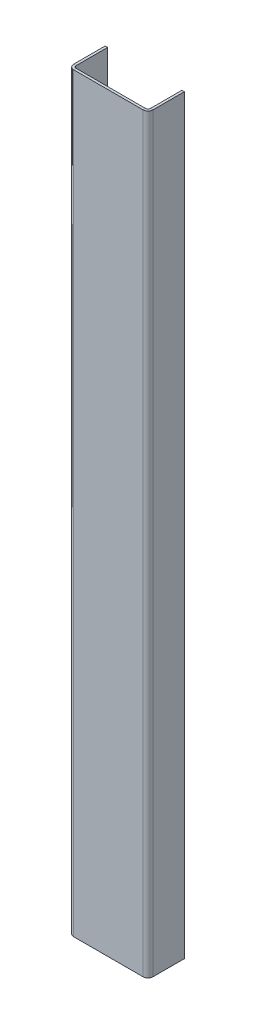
ISO-10303-21;
HEADER;
FILE_DESCRIPTION(('STEP AP214'),'2;1');
FILE_NAME('part.step','',(''),(''),'','','');
FILE_SCHEMA(('AUTOMOTIVE_DESIGN { 1 0 10303 214 1 1 1 1 }'));
ENDSEC;
DATA;
#1=APPLICATION_CONTEXT('core data for automotive mechanical design processes');
#2=APPLICATION_PROTOCOL_DEFINITION('international standard','automotive_design',2000,#1);
#3=PRODUCT_CONTEXT('',#1,'mechanical');
#4=PRODUCT('Part','Part','',(#3));
#5=PRODUCT_RELATED_PRODUCT_CATEGORY('part','',(#4));
#6=PRODUCT_DEFINITION_FORMATION('','',#4);
#7=PRODUCT_DEFINITION_CONTEXT('part definition',#1,'design');
#8=PRODUCT_DEFINITION('design','',#6,#7);
#9=PRODUCT_DEFINITION_SHAPE('','',#8);
#10=(LENGTH_UNIT() NAMED_UNIT(*) SI_UNIT(.MILLI.,.METRE.));
#11=(NAMED_UNIT(*) PLANE_ANGLE_UNIT() SI_UNIT($,.RADIAN.));
#12=(NAMED_UNIT(*) SI_UNIT($,.STERADIAN.) SOLID_ANGLE_UNIT());
#13=UNCERTAINTY_MEASURE_WITH_UNIT(LENGTH_MEASURE(1.E-05),#10,'distance_accuracy_value','');
#14=(GEOMETRIC_REPRESENTATION_CONTEXT(3) GLOBAL_UNCERTAINTY_ASSIGNED_CONTEXT((#13)) GLOBAL_UNIT_ASSIGNED_CONTEXT((#10,
#11,#12)) REPRESENTATION_CONTEXT('',''));
#15=CARTESIAN_POINT('',(0.,0.,0.));
#16=DIRECTION('',(0.,0.,1.));
#17=DIRECTION('',(1.,0.,0.));
#18=AXIS2_PLACEMENT_3D('',#15,#16,#17);
#19=CARTESIAN_POINT('',(66.6749999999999,1444.625,0.));
#20=DIRECTION('',(0.,1.,0.));
#21=DIRECTION('',(0.,0.,1.));
#22=AXIS2_PLACEMENT_3D('',#19,#20,#21);
#23=PLANE('',#22);
#24=DIRECTION('',(0.,0.,-1.));
#25=VECTOR('',#24,1.);
#26=CARTESIAN_POINT('',(66.6749999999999,1444.625,0.));
#27=LINE('',#26,#25);
#28=CARTESIAN_POINT('',(66.6749999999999,1444.625,0.));
#29=VERTEX_POINT('',#28);
#30=CARTESIAN_POINT('',(66.6749999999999,1444.625,-4.7625));
#31=VERTEX_POINT('',#30);
#32=EDGE_CURVE('E11',#29,#31,#27,.T.);
#33=ORIENTED_EDGE('',*,*,#32,.F.);
#34=CARTESIAN_POINT('',(66.675,1444.625,-9.525));
#35=DIRECTION('',(0.,1.,0.));
#36=DIRECTION('',(0.,0.,1.));
#37=AXIS2_PLACEMENT_3D('',#34,#35,#36);
#38=CIRCLE('',#37,9.525);
#39=CARTESIAN_POINT('',(76.2,1444.625,-9.525));
#40=VERTEX_POINT('',#39);
#41=EDGE_CURVE('E247',#40,#29,#38,.F.);
#42=ORIENTED_EDGE('',*,*,#41,.F.);
#43=DIRECTION('',(1.,0.,0.));
#44=VECTOR('',#43,1.);
#45=CARTESIAN_POINT('',(71.4375,1444.625,-9.525));
#46=LINE('',#45,#44);
#47=CARTESIAN_POINT('',(71.4375,1444.625,-9.525));
#48=VERTEX_POINT('',#47);
#49=EDGE_CURVE('E45',#48,#40,#46,.T.);
#50=ORIENTED_EDGE('',*,*,#49,.F.);
#51=CARTESIAN_POINT('',(66.675,1444.625,-9.525));
#52=DIRECTION('',(0.,1.,0.));
#53=DIRECTION('',(1.,0.,0.));
#54=AXIS2_PLACEMENT_3D('',#51,#52,#53);
#55=CIRCLE('',#54,4.7625);
#56=EDGE_CURVE('E146',#48,#31,#55,.F.);
#57=ORIENTED_EDGE('',*,*,#56,.T.);
#58=EDGE_LOOP('',(#33,#42,#50,#57));
#59=FACE_BOUND('',#58,.T.);
#60=ADVANCED_FACE('F37',(#59),#23,.T.);
#61=CARTESIAN_POINT('',(71.4375,1444.625,-9.525));
#62=DIRECTION('',(0.,1.,0.));
#63=DIRECTION('',(0.,0.,1.));
#64=AXIS2_PLACEMENT_3D('',#61,#62,#63);
#65=PLANE('',#64);
#66=DIRECTION('',(-1.,0.,0.));
#67=VECTOR('',#66,1.);
#68=CARTESIAN_POINT('',(-76.2,1444.625,0.));
#69=LINE('',#68,#67);
#70=CARTESIAN_POINT('',(-66.675,1444.625,0.));
#71=VERTEX_POINT('',#70);
#72=EDGE_CURVE('E140',#29,#71,#69,.T.);
#73=ORIENTED_EDGE('',*,*,#72,.F.);
#74=ORIENTED_EDGE('',*,*,#32,.T.);
#75=DIRECTION('',(1.,0.,0.));
#76=VECTOR('',#75,1.);
#77=CARTESIAN_POINT('',(-76.2,1444.625,-4.7625));
#78=LINE('',#77,#76);
#79=CARTESIAN_POINT('',(-66.675,1444.625,-4.7625));
#80=VERTEX_POINT('',#79);
#81=EDGE_CURVE('E137',#31,#80,#78,.F.);
#82=ORIENTED_EDGE('',*,*,#81,.T.);
#83=DIRECTION('',(0.,0.,1.));
#84=VECTOR('',#83,1.);
#85=CARTESIAN_POINT('',(-66.675,1444.625,-4.7625));
#86=LINE('',#85,#84);
#87=EDGE_CURVE('E228',#80,#71,#86,.T.);
#88=ORIENTED_EDGE('',*,*,#87,.T.);
#89=EDGE_LOOP('',(#73,#74,#82,#88));
#90=FACE_BOUND('',#89,.T.);
#91=ADVANCED_FACE('F135',(#90),#65,.T.);
#92=CARTESIAN_POINT('',(76.2,0.,-9.525));
#93=DIRECTION('',(0.,-1.,0.));
#94=DIRECTION('',(0.,0.,-1.));
#95=AXIS2_PLACEMENT_3D('',#92,#93,#94);
#96=PLANE('',#95);
#97=DIRECTION('',(-1.,0.,0.));
#98=VECTOR('',#97,1.);
#99=CARTESIAN_POINT('',(76.2,0.,-9.525));
#100=LINE('',#99,#98);
#101=CARTESIAN_POINT('',(76.2,0.,-9.525));
#102=VERTEX_POINT('',#101);
#103=CARTESIAN_POINT('',(71.4375,0.,-9.525));
#104=VERTEX_POINT('',#103);
#105=EDGE_CURVE('E233',#102,#104,#100,.T.);
#106=ORIENTED_EDGE('',*,*,#105,.F.);
#107=CARTESIAN_POINT('',(66.675,0.,-9.525));
#108=DIRECTION('',(0.,1.,0.));
#109=DIRECTION('',(0.,0.,1.));
#110=AXIS2_PLACEMENT_3D('',#107,#108,#109);
#111=CIRCLE('',#110,9.525);
#112=CARTESIAN_POINT('',(66.6749999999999,0.,0.));
#113=VERTEX_POINT('',#112);
#114=EDGE_CURVE('E185',#102,#113,#111,.F.);
#115=ORIENTED_EDGE('',*,*,#114,.T.);
#116=DIRECTION('',(0.,0.,1.));
#117=VECTOR('',#116,1.);
#118=CARTESIAN_POINT('',(66.6749999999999,0.,-4.7625));
#119=LINE('',#118,#117);
#120=CARTESIAN_POINT('',(66.6749999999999,0.,-4.7625));
#121=VERTEX_POINT('',#120);
#122=EDGE_CURVE('E231',#121,#113,#119,.T.);
#123=ORIENTED_EDGE('',*,*,#122,.F.);
#124=CARTESIAN_POINT('',(66.675,0.,-9.525));
#125=DIRECTION('',(0.,1.,0.));
#126=DIRECTION('',(1.,0.,0.));
#127=AXIS2_PLACEMENT_3D('',#124,#125,#126);
#128=CIRCLE('',#127,4.7625);
#129=EDGE_CURVE('E158',#104,#121,#128,.F.);
#130=ORIENTED_EDGE('',*,*,#129,.F.);
#131=EDGE_LOOP('',(#106,#115,#123,#130));
#132=FACE_BOUND('',#131,.T.);
#133=ADVANCED_FACE('F285',(#132),#96,.T.);
#134=CARTESIAN_POINT('',(66.6749999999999,0.,-4.7625));
#135=DIRECTION('',(0.,-1.,0.));
#136=DIRECTION('',(0.,0.,-1.));
#137=AXIS2_PLACEMENT_3D('',#134,#135,#136);
#138=PLANE('',#137);
#139=DIRECTION('',(0.,0.,1.));
#140=VECTOR('',#139,1.);
#141=CARTESIAN_POINT('',(76.2,0.,0.));
#142=LINE('',#141,#140);
#143=CARTESIAN_POINT('',(76.2,0.,-69.85));
#144=VERTEX_POINT('',#143);
#145=EDGE_CURVE('E188',#144,#102,#142,.T.);
#146=ORIENTED_EDGE('',*,*,#145,.T.);
#147=ORIENTED_EDGE('',*,*,#105,.T.);
#148=DIRECTION('',(0.,0.,-1.));
#149=VECTOR('',#148,1.);
#150=CARTESIAN_POINT('',(71.4375,0.,0.));
#151=LINE('',#150,#149);
#152=CARTESIAN_POINT('',(71.4375,0.,-69.85));
#153=VERTEX_POINT('',#152);
#154=EDGE_CURVE('E194',#153,#104,#151,.F.);
#155=ORIENTED_EDGE('',*,*,#154,.F.);
#156=DIRECTION('',(1.,0.,0.));
#157=VECTOR('',#156,1.);
#158=CARTESIAN_POINT('',(71.4375,0.,-69.85));
#159=LINE('',#158,#157);
#160=EDGE_CURVE('E191',#153,#144,#159,.T.);
#161=ORIENTED_EDGE('',*,*,#160,.T.);
#162=EDGE_LOOP('',(#146,#147,#155,#161));
#163=FACE_BOUND('',#162,.T.);
#164=ADVANCED_FACE('F288',(#163),#138,.T.);
#165=CARTESIAN_POINT('',(-76.2,1444.625,-9.525));
#166=DIRECTION('',(0.,1.,0.));
#167=DIRECTION('',(0.,0.,1.));
#168=AXIS2_PLACEMENT_3D('',#165,#166,#167);
#169=PLANE('',#168);
#170=DIRECTION('',(1.,0.,0.));
#171=VECTOR('',#170,1.);
#172=CARTESIAN_POINT('',(-76.2,1444.625,-9.525));
#173=LINE('',#172,#171);
#174=CARTESIAN_POINT('',(-76.2,1444.625,-9.525));
#175=VERTEX_POINT('',#174);
#176=CARTESIAN_POINT('',(-71.4375,1444.625,-9.525));
#177=VERTEX_POINT('',#176);
#178=EDGE_CURVE('E53',#175,#177,#173,.T.);
#179=ORIENTED_EDGE('',*,*,#178,.F.);
#180=CARTESIAN_POINT('',(-66.675,1444.625,-9.525));
#181=DIRECTION('',(0.,1.,0.));
#182=DIRECTION('',(0.,0.,1.));
#183=AXIS2_PLACEMENT_3D('',#180,#181,#182);
#184=CIRCLE('',#183,9.525);
#185=EDGE_CURVE('E257',#71,#175,#184,.F.);
#186=ORIENTED_EDGE('',*,*,#185,.F.);
#187=ORIENTED_EDGE('',*,*,#87,.F.);
#188=CARTESIAN_POINT('',(-66.675,1444.625,-9.525));
#189=DIRECTION('',(0.,1.,0.));
#190=DIRECTION('',(1.,0.,0.));
#191=AXIS2_PLACEMENT_3D('',#188,#189,#190);
#192=CIRCLE('',#191,4.7625);
#193=EDGE_CURVE('E166',#80,#177,#192,.F.);
#194=ORIENTED_EDGE('',*,*,#193,.T.);
#195=EDGE_LOOP('',(#179,#186,#187,#194));
#196=FACE_BOUND('',#195,.T.);
#197=ADVANCED_FACE('F280',(#196),#169,.T.);
#198=CARTESIAN_POINT('',(-66.675,1444.625,-4.7625));
#199=DIRECTION('',(0.,1.,0.));
#200=DIRECTION('',(0.,0.,1.));
#201=AXIS2_PLACEMENT_3D('',#198,#199,#200);
#202=PLANE('',#201);
#203=DIRECTION('',(0.,0.,-1.));
#204=VECTOR('',#203,1.);
#205=CARTESIAN_POINT('',(-76.2,1444.625,0.));
#206=LINE('',#205,#204);
#207=CARTESIAN_POINT('',(-76.2,1444.625,-69.85));
#208=VERTEX_POINT('',#207);
#209=EDGE_CURVE('E260',#175,#208,#206,.T.);
#210=ORIENTED_EDGE('',*,*,#209,.F.);
#211=ORIENTED_EDGE('',*,*,#178,.T.);
#212=DIRECTION('',(0.,0.,-1.));
#213=VECTOR('',#212,1.);
#214=CARTESIAN_POINT('',(-71.4375,1444.625,0.));
#215=LINE('',#214,#213);
#216=CARTESIAN_POINT('',(-71.4375,1444.625,-69.85));
#217=VERTEX_POINT('',#216);
#218=EDGE_CURVE('E107',#177,#217,#215,.T.);
#219=ORIENTED_EDGE('',*,*,#218,.T.);
#220=DIRECTION('',(1.,0.,0.));
#221=VECTOR('',#220,1.);
#222=CARTESIAN_POINT('',(-76.2,1444.625,-69.85));
#223=LINE('',#222,#221);
#224=EDGE_CURVE('E263',#208,#217,#223,.T.);
#225=ORIENTED_EDGE('',*,*,#224,.F.);
#226=EDGE_LOOP('',(#210,#211,#219,#225));
#227=FACE_BOUND('',#226,.T.);
#228=ADVANCED_FACE('F269',(#227),#202,.T.);
#229=CARTESIAN_POINT('',(-66.675,0.,0.));
#230=DIRECTION('',(0.,-1.,0.));
#231=DIRECTION('',(0.,0.,-1.));
#232=AXIS2_PLACEMENT_3D('',#229,#230,#231);
#233=PLANE('',#232);
#234=DIRECTION('',(0.,0.,-1.));
#235=VECTOR('',#234,1.);
#236=CARTESIAN_POINT('',(-66.675,0.,0.));
#237=LINE('',#236,#235);
#238=CARTESIAN_POINT('',(-66.675,0.,0.));
#239=VERTEX_POINT('',#238);
#240=CARTESIAN_POINT('',(-66.675,0.,-4.7625));
#241=VERTEX_POINT('',#240);
#242=EDGE_CURVE('E94',#239,#241,#237,.T.);
#243=ORIENTED_EDGE('',*,*,#242,.F.);
#244=CARTESIAN_POINT('',(-66.675,0.,-9.525));
#245=DIRECTION('',(0.,1.,0.));
#246=DIRECTION('',(0.,0.,1.));
#247=AXIS2_PLACEMENT_3D('',#244,#245,#246);
#248=CIRCLE('',#247,9.525);
#249=CARTESIAN_POINT('',(-76.2,0.,-9.525));
#250=VERTEX_POINT('',#249);
#251=EDGE_CURVE('E181',#239,#250,#248,.F.);
#252=ORIENTED_EDGE('',*,*,#251,.T.);
#253=DIRECTION('',(-1.,0.,0.));
#254=VECTOR('',#253,1.);
#255=CARTESIAN_POINT('',(-71.4375,0.,-9.525));
#256=LINE('',#255,#254);
#257=CARTESIAN_POINT('',(-71.4375,0.,-9.525));
#258=VERTEX_POINT('',#257);
#259=EDGE_CURVE('E101',#258,#250,#256,.T.);
#260=ORIENTED_EDGE('',*,*,#259,.F.);
#261=CARTESIAN_POINT('',(-66.675,0.,-9.525));
#262=DIRECTION('',(0.,1.,0.));
#263=DIRECTION('',(1.,0.,0.));
#264=AXIS2_PLACEMENT_3D('',#261,#262,#263);
#265=CIRCLE('',#264,4.7625);
#266=EDGE_CURVE('E200',#241,#258,#265,.F.);
#267=ORIENTED_EDGE('',*,*,#266,.F.);
#268=EDGE_LOOP('',(#243,#252,#260,#267));
#269=FACE_BOUND('',#268,.T.);
#270=ADVANCED_FACE('F317',(#269),#233,.T.);
#271=CARTESIAN_POINT('',(-71.4375,0.,-9.525));
#272=DIRECTION('',(0.,-1.,0.));
#273=DIRECTION('',(0.,0.,-1.));
#274=AXIS2_PLACEMENT_3D('',#271,#272,#273);
#275=PLANE('',#274);
#276=DIRECTION('',(-1.,0.,0.));
#277=VECTOR('',#276,1.);
#278=CARTESIAN_POINT('',(-76.2,0.,0.));
#279=LINE('',#278,#277);
#280=EDGE_CURVE('E183',#113,#239,#279,.T.);
#281=ORIENTED_EDGE('',*,*,#280,.T.);
#282=ORIENTED_EDGE('',*,*,#242,.T.);
#283=DIRECTION('',(1.,0.,0.));
#284=VECTOR('',#283,1.);
#285=CARTESIAN_POINT('',(-76.2,0.,-4.7625));
#286=LINE('',#285,#284);
#287=EDGE_CURVE('E198',#121,#241,#286,.F.);
#288=ORIENTED_EDGE('',*,*,#287,.F.);
#289=ORIENTED_EDGE('',*,*,#122,.T.);
#290=EDGE_LOOP('',(#281,#282,#288,#289));
#291=FACE_BOUND('',#290,.T.);
#292=ADVANCED_FACE('F320',(#291),#275,.T.);
#293=CARTESIAN_POINT('',(-71.4375,1444.625,0.));
#294=DIRECTION('',(-1.,0.,0.));
#295=DIRECTION('',(0.,0.,1.));
#296=AXIS2_PLACEMENT_3D('',#293,#294,#295);
#297=PLANE('',#296);
#298=DIRECTION('',(0.,0.,-1.));
#299=VECTOR('',#298,1.);
#300=CARTESIAN_POINT('',(-71.4375,0.,0.));
#301=LINE('',#300,#299);
#302=CARTESIAN_POINT('',(-71.4375,0.,-69.85));
#303=VERTEX_POINT('',#302);
#304=EDGE_CURVE('E172',#258,#303,#301,.T.);
#305=ORIENTED_EDGE('',*,*,#304,.T.);
#306=DIRECTION('',(0.,-1.,0.));
#307=VECTOR('',#306,1.);
#308=CARTESIAN_POINT('',(-71.4375,1444.625,-69.85));
#309=LINE('',#308,#307);
#310=EDGE_CURVE('E224',#217,#303,#309,.T.);
#311=ORIENTED_EDGE('',*,*,#310,.F.);
#312=ORIENTED_EDGE('',*,*,#218,.F.);
#313=DIRECTION('',(0.,-1.,0.));
#314=VECTOR('',#313,1.);
#315=CARTESIAN_POINT('',(-71.4375,1444.625,-9.525));
#316=LINE('',#315,#314);
#317=EDGE_CURVE('E168',#177,#258,#316,.T.);
#318=ORIENTED_EDGE('',*,*,#317,.T.);
#319=EDGE_LOOP('',(#305,#311,#312,#318));
#320=FACE_BOUND('',#319,.T.);
#321=ADVANCED_FACE('F323',(#320),#297,.F.);
#322=CARTESIAN_POINT('',(-76.2,1444.625,-69.85));
#323=DIRECTION('',(0.,0.,-1.));
#324=DIRECTION('',(-1.,0.,0.));
#325=AXIS2_PLACEMENT_3D('',#322,#323,#324);
#326=PLANE('',#325);
#327=DIRECTION('',(1.,0.,0.));
#328=VECTOR('',#327,1.);
#329=CARTESIAN_POINT('',(-76.2,0.,-69.85));
#330=LINE('',#329,#328);
#331=CARTESIAN_POINT('',(-76.2,0.,-69.85));
#332=VERTEX_POINT('',#331);
#333=EDGE_CURVE('E175',#332,#303,#330,.T.);
#334=ORIENTED_EDGE('',*,*,#333,.F.);
#335=DIRECTION('',(0.,-1.,0.));
#336=VECTOR('',#335,1.);
#337=CARTESIAN_POINT('',(-76.2,1444.625,-69.85));
#338=LINE('',#337,#336);
#339=EDGE_CURVE('E222',#208,#332,#338,.T.);
#340=ORIENTED_EDGE('',*,*,#339,.F.);
#341=ORIENTED_EDGE('',*,*,#224,.T.);
#342=ORIENTED_EDGE('',*,*,#310,.T.);
#343=EDGE_LOOP('',(#334,#340,#341,#342));
#344=FACE_BOUND('',#343,.T.);
#345=ADVANCED_FACE('F268',(#344),#326,.T.);
#346=CARTESIAN_POINT('',(-76.2,1444.625,0.));
#347=DIRECTION('',(-1.,0.,0.));
#348=DIRECTION('',(0.,0.,1.));
#349=AXIS2_PLACEMENT_3D('',#346,#347,#348);
#350=PLANE('',#349);
#351=DIRECTION('',(0.,0.,-1.));
#352=VECTOR('',#351,1.);
#353=CARTESIAN_POINT('',(-76.2,0.,0.));
#354=LINE('',#353,#352);
#355=EDGE_CURVE('E178',#250,#332,#354,.T.);
#356=ORIENTED_EDGE('',*,*,#355,.F.);
#357=DIRECTION('',(0.,-1.,0.));
#358=VECTOR('',#357,1.);
#359=CARTESIAN_POINT('',(-76.2,1444.625,-9.525));
#360=LINE('',#359,#358);
#361=EDGE_CURVE('E219',#175,#250,#360,.T.);
#362=ORIENTED_EDGE('',*,*,#361,.F.);
#363=ORIENTED_EDGE('',*,*,#209,.T.);
#364=ORIENTED_EDGE('',*,*,#339,.T.);
#365=EDGE_LOOP('',(#356,#362,#363,#364));
#366=FACE_BOUND('',#365,.T.);
#367=ADVANCED_FACE('F273',(#366),#350,.T.);
#368=CARTESIAN_POINT('',(-66.675,1444.625,-9.525));
#369=DIRECTION('',(0.,-1.,0.));
#370=DIRECTION('',(0.,0.,-1.));
#371=AXIS2_PLACEMENT_3D('',#368,#369,#370);
#372=CYLINDRICAL_SURFACE('',#371,9.525);
#373=ORIENTED_EDGE('',*,*,#251,.F.);
#374=DIRECTION('',(0.,-1.,0.));
#375=VECTOR('',#374,1.);
#376=CARTESIAN_POINT('',(-66.675,1444.625,0.));
#377=LINE('',#376,#375);
#378=EDGE_CURVE('E216',#71,#239,#377,.T.);
#379=ORIENTED_EDGE('',*,*,#378,.F.);
#380=ORIENTED_EDGE('',*,*,#185,.T.);
#381=ORIENTED_EDGE('',*,*,#361,.T.);
#382=EDGE_LOOP('',(#373,#379,#380,#381));
#383=FACE_BOUND('',#382,.T.);
#384=ADVANCED_FACE('F276',(#383),#372,.T.);
#385=CARTESIAN_POINT('',(-76.2,1444.625,0.));
#386=DIRECTION('',(0.,0.,1.));
#387=DIRECTION('',(1.,0.,0.));
#388=AXIS2_PLACEMENT_3D('',#385,#386,#387);
#389=PLANE('',#388);
#390=ORIENTED_EDGE('',*,*,#280,.F.);
#391=DIRECTION('',(0.,-1.,0.));
#392=VECTOR('',#391,1.);
#393=CARTESIAN_POINT('',(66.6749999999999,1444.625,0.));
#394=LINE('',#393,#392);
#395=EDGE_CURVE('E213',#29,#113,#394,.T.);
#396=ORIENTED_EDGE('',*,*,#395,.F.);
#397=ORIENTED_EDGE('',*,*,#72,.T.);
#398=ORIENTED_EDGE('',*,*,#378,.T.);
#399=EDGE_LOOP('',(#390,#396,#397,#398));
#400=FACE_BOUND('',#399,.T.);
#401=ADVANCED_FACE('F283',(#400),#389,.T.);
#402=CARTESIAN_POINT('',(66.675,1444.625,-9.525));
#403=DIRECTION('',(0.,-1.,0.));
#404=DIRECTION('',(0.,0.,-1.));
#405=AXIS2_PLACEMENT_3D('',#402,#403,#404);
#406=CYLINDRICAL_SURFACE('',#405,9.525);
#407=ORIENTED_EDGE('',*,*,#114,.F.);
#408=DIRECTION('',(0.,-1.,0.));
#409=VECTOR('',#408,1.);
#410=CARTESIAN_POINT('',(76.2,1444.625,-9.525));
#411=LINE('',#410,#409);
#412=EDGE_CURVE('E210',#40,#102,#411,.T.);
#413=ORIENTED_EDGE('',*,*,#412,.F.);
#414=ORIENTED_EDGE('',*,*,#41,.T.);
#415=ORIENTED_EDGE('',*,*,#395,.T.);
#416=EDGE_LOOP('',(#407,#413,#414,#415));
#417=FACE_BOUND('',#416,.T.);
#418=ADVANCED_FACE('F246',(#417),#406,.T.);
#419=CARTESIAN_POINT('',(76.2,1444.625,0.));
#420=DIRECTION('',(1.,0.,0.));
#421=DIRECTION('',(0.,0.,-1.));
#422=AXIS2_PLACEMENT_3D('',#419,#420,#421);
#423=PLANE('',#422);
#424=ORIENTED_EDGE('',*,*,#145,.F.);
#425=DIRECTION('',(0.,-1.,0.));
#426=VECTOR('',#425,1.);
#427=CARTESIAN_POINT('',(76.2,1444.625,-69.85));
#428=LINE('',#427,#426);
#429=CARTESIAN_POINT('',(76.2,1444.625,-69.85));
#430=VERTEX_POINT('',#429);
#431=EDGE_CURVE('E208',#430,#144,#428,.T.);
#432=ORIENTED_EDGE('',*,*,#431,.F.);
#433=DIRECTION('',(0.,0.,1.));
#434=VECTOR('',#433,1.);
#435=CARTESIAN_POINT('',(76.2,1444.625,0.));
#436=LINE('',#435,#434);
#437=EDGE_CURVE('E240',#430,#40,#436,.T.);
#438=ORIENTED_EDGE('',*,*,#437,.T.);
#439=ORIENTED_EDGE('',*,*,#412,.T.);
#440=EDGE_LOOP('',(#424,#432,#438,#439));
#441=FACE_BOUND('',#440,.T.);
#442=ADVANCED_FACE('F251',(#441),#423,.T.);
#443=CARTESIAN_POINT('',(71.4375,1444.625,-69.85));
#444=DIRECTION('',(0.,0.,-1.));
#445=DIRECTION('',(-1.,0.,0.));
#446=AXIS2_PLACEMENT_3D('',#443,#444,#445);
#447=PLANE('',#446);
#448=ORIENTED_EDGE('',*,*,#160,.F.);
#449=DIRECTION('',(0.,-1.,0.));
#450=VECTOR('',#449,1.);
#451=CARTESIAN_POINT('',(71.4375,1444.625,-69.85));
#452=LINE('',#451,#450);
#453=CARTESIAN_POINT('',(71.4375,1444.625,-69.85));
#454=VERTEX_POINT('',#453);
#455=EDGE_CURVE('E206',#454,#153,#452,.T.);
#456=ORIENTED_EDGE('',*,*,#455,.F.);
#457=DIRECTION('',(1.,0.,0.));
#458=VECTOR('',#457,1.);
#459=CARTESIAN_POINT('',(71.4375,1444.625,-69.85));
#460=LINE('',#459,#458);
#461=EDGE_CURVE('E252',#454,#430,#460,.T.);
#462=ORIENTED_EDGE('',*,*,#461,.T.);
#463=ORIENTED_EDGE('',*,*,#431,.T.);
#464=EDGE_LOOP('',(#448,#456,#462,#463));
#465=FACE_BOUND('',#464,.T.);
#466=ADVANCED_FACE('F293',(#465),#447,.T.);
#467=CARTESIAN_POINT('',(71.4375,1444.625,0.));
#468=DIRECTION('',(1.,0.,0.));
#469=DIRECTION('',(0.,0.,-1.));
#470=AXIS2_PLACEMENT_3D('',#467,#468,#469);
#471=PLANE('',#470);
#472=ORIENTED_EDGE('',*,*,#154,.T.);
#473=DIRECTION('',(0.,-1.,0.));
#474=VECTOR('',#473,1.);
#475=CARTESIAN_POINT('',(71.4375,1444.625,-9.525));
#476=LINE('',#475,#474);
#477=EDGE_CURVE('E160',#48,#104,#476,.T.);
#478=ORIENTED_EDGE('',*,*,#477,.F.);
#479=DIRECTION('',(0.,0.,-1.));
#480=VECTOR('',#479,1.);
#481=CARTESIAN_POINT('',(71.4375,1444.625,0.));
#482=LINE('',#481,#480);
#483=EDGE_CURVE('E151',#454,#48,#482,.F.);
#484=ORIENTED_EDGE('',*,*,#483,.F.);
#485=ORIENTED_EDGE('',*,*,#455,.T.);
#486=EDGE_LOOP('',(#472,#478,#484,#485));
#487=FACE_BOUND('',#486,.T.);
#488=ADVANCED_FACE('F291',(#487),#471,.F.);
#489=CARTESIAN_POINT('',(66.675,1444.625,-9.525));
#490=DIRECTION('',(0.,-1.,0.));
#491=DIRECTION('',(0.,0.,-1.));
#492=AXIS2_PLACEMENT_3D('',#489,#490,#491);
#493=CYLINDRICAL_SURFACE('',#492,4.7625);
#494=ORIENTED_EDGE('',*,*,#129,.T.);
#495=DIRECTION('',(0.,-1.,0.));
#496=VECTOR('',#495,1.);
#497=CARTESIAN_POINT('',(66.6749999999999,1444.625,-4.7625));
#498=LINE('',#497,#496);
#499=EDGE_CURVE('E155',#31,#121,#498,.T.);
#500=ORIENTED_EDGE('',*,*,#499,.F.);
#501=ORIENTED_EDGE('',*,*,#56,.F.);
#502=ORIENTED_EDGE('',*,*,#477,.T.);
#503=EDGE_LOOP('',(#494,#500,#501,#502));
#504=FACE_BOUND('',#503,.T.);
#505=ADVANCED_FACE('F156',(#504),#493,.F.);
#506=CARTESIAN_POINT('',(-76.2,1444.625,-4.7625));
#507=DIRECTION('',(0.,0.,1.));
#508=DIRECTION('',(1.,0.,0.));
#509=AXIS2_PLACEMENT_3D('',#506,#507,#508);
#510=PLANE('',#509);
#511=ORIENTED_EDGE('',*,*,#287,.T.);
#512=DIRECTION('',(0.,-1.,0.));
#513=VECTOR('',#512,1.);
#514=CARTESIAN_POINT('',(-66.675,1444.625,-4.7625));
#515=LINE('',#514,#513);
#516=EDGE_CURVE('E161',#80,#241,#515,.T.);
#517=ORIENTED_EDGE('',*,*,#516,.F.);
#518=ORIENTED_EDGE('',*,*,#81,.F.);
#519=ORIENTED_EDGE('',*,*,#499,.T.);
#520=EDGE_LOOP('',(#511,#517,#518,#519));
#521=FACE_BOUND('',#520,.T.);
#522=ADVANCED_FACE('F163',(#521),#510,.F.);
#523=CARTESIAN_POINT('',(-66.675,1444.625,-9.525));
#524=DIRECTION('',(0.,-1.,0.));
#525=DIRECTION('',(0.,0.,-1.));
#526=AXIS2_PLACEMENT_3D('',#523,#524,#525);
#527=CYLINDRICAL_SURFACE('',#526,4.7625);
#528=ORIENTED_EDGE('',*,*,#266,.T.);
#529=ORIENTED_EDGE('',*,*,#317,.F.);
#530=ORIENTED_EDGE('',*,*,#193,.F.);
#531=ORIENTED_EDGE('',*,*,#516,.T.);
#532=EDGE_LOOP('',(#528,#529,#530,#531));
#533=FACE_BOUND('',#532,.T.);
#534=ADVANCED_FACE('F375',(#533),#527,.F.);
#535=CARTESIAN_POINT('',(-66.675,1444.625,-9.525));
#536=DIRECTION('',(0.,1.,0.));
#537=DIRECTION('',(1.,0.,0.));
#538=AXIS2_PLACEMENT_3D('',#535,#536,#537);
#539=PLANE('',#538);
#540=ORIENTED_EDGE('',*,*,#483,.T.);
#541=ORIENTED_EDGE('',*,*,#49,.T.);
#542=ORIENTED_EDGE('',*,*,#437,.F.);
#543=ORIENTED_EDGE('',*,*,#461,.F.);
#544=EDGE_LOOP('',(#540,#541,#542,#543));
#545=FACE_BOUND('',#544,.T.);
#546=ADVANCED_FACE('F237',(#545),#539,.T.);
#547=CARTESIAN_POINT('',(-66.675,0.,-9.525));
#548=DIRECTION('',(0.,1.,0.));
#549=DIRECTION('',(1.,0.,0.));
#550=AXIS2_PLACEMENT_3D('',#547,#548,#549);
#551=PLANE('',#550);
#552=ORIENTED_EDGE('',*,*,#304,.F.);
#553=ORIENTED_EDGE('',*,*,#259,.T.);
#554=ORIENTED_EDGE('',*,*,#355,.T.);
#555=ORIENTED_EDGE('',*,*,#333,.T.);
#556=EDGE_LOOP('',(#552,#553,#554,#555));
#557=FACE_BOUND('',#556,.T.);
#558=ADVANCED_FACE('F395',(#557),#551,.F.);
#559=CLOSED_SHELL('',(#60,#91,#133,#164,#197,#228,#270,#292,#321,#345,#367,#384,#401,#418,#442,
#466,#488,#505,#522,#534,#546,#558));
#560=MANIFOLD_SOLID_BREP('B2',#559);
#561=ADVANCED_BREP_SHAPE_REPRESENTATION('',(#18,#560),#14);
#562=SHAPE_DEFINITION_REPRESENTATION(#9,#561);
ENDSEC;
END-ISO-10303-21;
